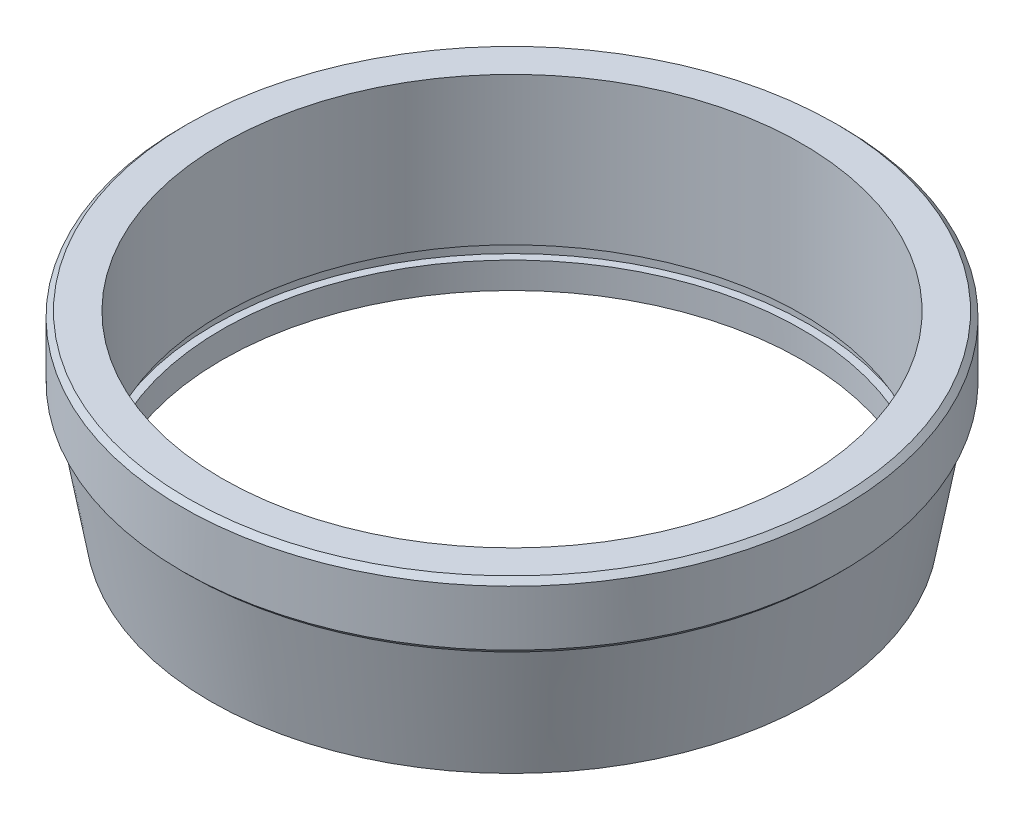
from build123d import *

# Parameters (mm, degrees)
SKICA1_R                 = 12.25
P_IDAT_VYSUNUT_M1_DEPTH  = 4.6
P_IDAT_VYSUNUT_M1_DRAFT  = -10
SKICA2_R                 = 12.5
P_IDAT_VYSUNUT_M2_DEPTH  = 2.5
ZKOSEN_1_SIZE            = 0.2
SKICA3_R                 = 11
ODEBRAT_VYSUNUT_M1_DEPTH = 2.5
ODEBRAT_START            = -4.6
SKICA4_R                 = 11
ODEBRAT_VYSUNUT_M2_DEPTH = 4.6
SKICA5_W                 = 0.3
SKICA5_H                 = 0.5


with BuildPart() as part:
    # Skica1 → P_idat vysunut_m1 (with draft: the straight prism first)
    with BuildSketch(Plane(origin=(0, 0, 0), x_dir=(1, 0, 0), z_dir=(0, 1, 0))):
        Circle(SKICA1_R)
    extrude(amount=-P_IDAT_VYSUNUT_M1_DEPTH)
    # P_idat vysunut_m1: the draft: its side faces are tilted about the plane it starts from
    p_idat_vysunut_m1_sides = [part.faces().sort_by_distance(p)[0] for p in [
        (-12.25, -2.3, 0),
    ]]
    draft(p_idat_vysunut_m1_sides, Plane(origin=(0, 0, 0), x_dir=(1, 0, 0), z_dir=(0, 1, 0)), P_IDAT_VYSUNUT_M1_DRAFT)

    # Skica2 → P_idat vysunut_m2 (add)
    with BuildSketch(Plane(origin=(0, 0, 0), x_dir=(-1, 0, 0), z_dir=(0, 1, 0))):
        with Locations(Location((0, 0, 0), (0, 0, 90))):
            Circle(SKICA2_R)
    extrude(amount=P_IDAT_VYSUNUT_M2_DEPTH)

    # Zkosen_1
    zkosen_1_edges = [part.edges().sort_by_distance(p)[0] for p in [
        (0, 0, -12.5),
        (0, 2.5, -12.5),
    ]]
    chamfer(zkosen_1_edges, length=ZKOSEN_1_SIZE)

    # Skica3 → Odebrat vysunut_m1 (cut)
    with BuildSketch(Plane(origin=(0, 2.5, 0), x_dir=(1, 0, 0), z_dir=(0, 1, 0))):
        with Locations(Location((0, 0, 0), (0, 0, 270))):
            Circle(SKICA3_R)
    extrude(amount=-ODEBRAT_VYSUNUT_M1_DEPTH, mode=Mode.SUBTRACT)

    # Skica4 → Odebrat vysunut_m2 (cut)
    with BuildSketch(Plane.XZ.offset(4.6).offset(ODEBRAT_START)):
        with Locations(Location((0, 0, 0), (0, 0, 90))):
            Circle(SKICA4_R)
    extrude(amount=ODEBRAT_VYSUNUT_M2_DEPTH, mode=Mode.SUBTRACT)

    # Skica5 → Odebrat rotac_1 (revolve, cut)
    with BuildSketch(Plane.XY, mode=Mode.PRIVATE) as odebrat_rotac_1_sk:
        with Locations((-11.15, -3.35)):
            Rectangle(SKICA5_W, SKICA5_H)
    revolve(odebrat_rotac_1_sk.sketch.rotate(Axis((0, 2.5, 0), (0, -1, 0)), 270), axis=Axis((0, 2.5, 0), (0, -1, 0)), mode=Mode.SUBTRACT)


solid = part.part
